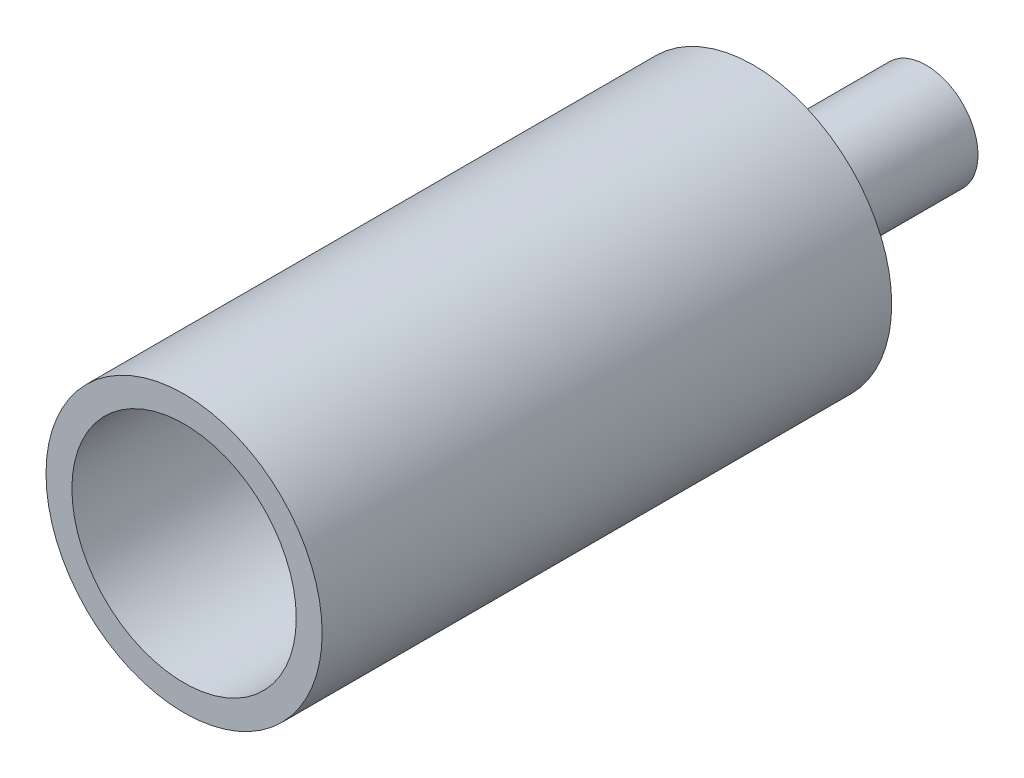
from build123d import *

# Parameters (mm, degrees)
ESQUISSE1_R      = 1.5
ESQUISSE1_R_2    = 0.75
EXTRUSION1_DEPTH = 5
EXTRUSION2_START = 1
ESQUISSE2_R      = 4
ESQUISSE2_R_2    = 0.75
EXTRUSION2_DEPTH = 1
EXTRUSION3_START = 15.5
ESQUISSE3_R      = 4
ESQUISSE3_R_2    = 3.25
EXTRUSION3_DEPTH = 15.5


with BuildPart() as part:
    # Esquisse1 → Extrusion1 (new body)
    with BuildSketch(Plane.XY):
        with Locations((-13, 3.928237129)):
            Circle(ESQUISSE1_R)
        with Locations((-13, 3.928237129)):
            Circle(ESQUISSE1_R_2, mode=Mode.SUBTRACT)
    extrude(amount=-EXTRUSION1_DEPTH)

    # Esquisse2 → Extrusion2 (add)
    with BuildSketch(Plane.XY.offset(EXTRUSION2_START)):
        with Locations((-13, 3.928237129)):
            Circle(ESQUISSE2_R)
        with Locations((-13, 3.928237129)):
            Circle(ESQUISSE2_R_2, mode=Mode.SUBTRACT)
    extrude(amount=-EXTRUSION2_DEPTH)

    # Esquisse3 → Extrusion3 (add)
    with BuildSketch(Plane.XY.offset(1).offset(EXTRUSION3_START)):
        with Locations((-13, 3.928237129)):
            Circle(ESQUISSE3_R)
        with Locations((-13, 3.928237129)):
            Circle(ESQUISSE3_R_2, mode=Mode.SUBTRACT)
    extrude(amount=-EXTRUSION3_DEPTH)


solid = part.part
